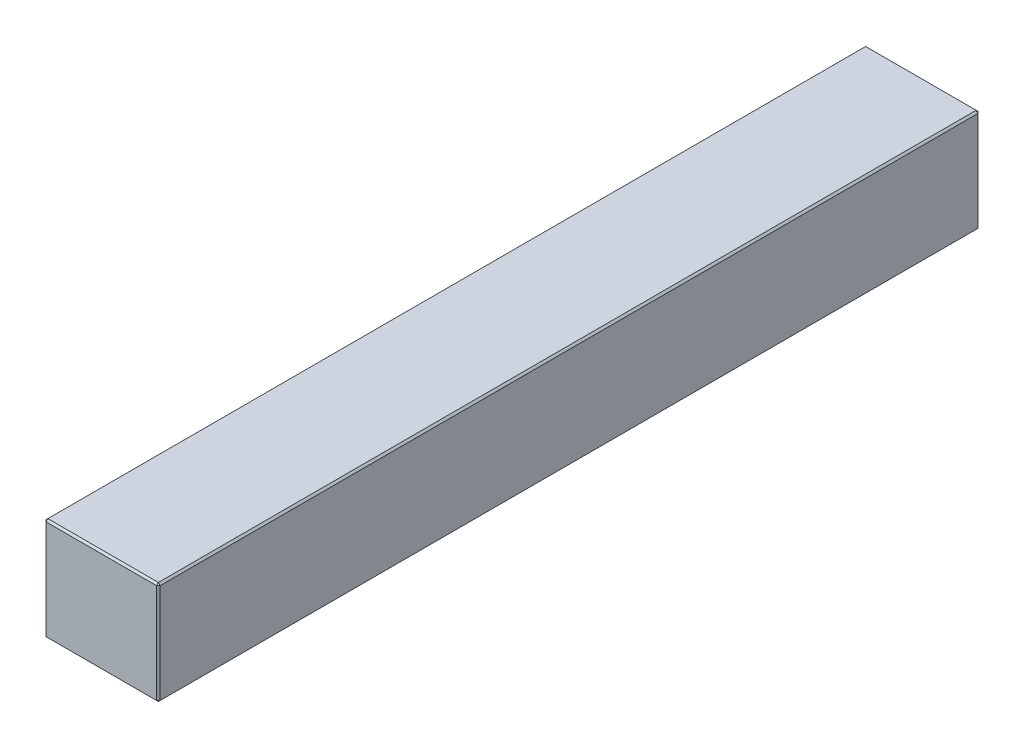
ISO-10303-21;
HEADER;
FILE_DESCRIPTION(('STEP AP214'),'2;1');
FILE_NAME('part.step','',(''),(''),'','','');
FILE_SCHEMA(('AUTOMOTIVE_DESIGN { 1 0 10303 214 1 1 1 1 }'));
ENDSEC;
DATA;
#1=APPLICATION_CONTEXT('core data for automotive mechanical design processes');
#2=APPLICATION_PROTOCOL_DEFINITION('international standard','automotive_design',2000,#1);
#3=PRODUCT_CONTEXT('',#1,'mechanical');
#4=PRODUCT('Part','Part','',(#3));
#5=PRODUCT_RELATED_PRODUCT_CATEGORY('part','',(#4));
#6=PRODUCT_DEFINITION_FORMATION('','',#4);
#7=PRODUCT_DEFINITION_CONTEXT('part definition',#1,'design');
#8=PRODUCT_DEFINITION('design','',#6,#7);
#9=PRODUCT_DEFINITION_SHAPE('','',#8);
#10=(LENGTH_UNIT() NAMED_UNIT(*) SI_UNIT(.MILLI.,.METRE.));
#11=(NAMED_UNIT(*) PLANE_ANGLE_UNIT() SI_UNIT($,.RADIAN.));
#12=(NAMED_UNIT(*) SI_UNIT($,.STERADIAN.) SOLID_ANGLE_UNIT());
#13=UNCERTAINTY_MEASURE_WITH_UNIT(LENGTH_MEASURE(1.E-05),#10,'distance_accuracy_value','');
#14=(GEOMETRIC_REPRESENTATION_CONTEXT(3) GLOBAL_UNCERTAINTY_ASSIGNED_CONTEXT((#13)) GLOBAL_UNIT_ASSIGNED_CONTEXT((#10,
#11,#12)) REPRESENTATION_CONTEXT('',''));
#15=CARTESIAN_POINT('',(0.,0.,0.));
#16=DIRECTION('',(0.,0.,1.));
#17=DIRECTION('',(1.,0.,0.));
#18=AXIS2_PLACEMENT_3D('',#15,#16,#17);
#19=CARTESIAN_POINT('',(-31.,56.,223.));
#20=DIRECTION('',(1.,0.,0.));
#21=DIRECTION('',(0.,0.,-1.));
#22=AXIS2_PLACEMENT_3D('',#19,#20,#21);
#23=PLANE('',#22);
#24=DIRECTION('',(0.,-1.,0.));
#25=VECTOR('',#24,1.);
#26=CARTESIAN_POINT('',(-31.,56.,-222.));
#27=LINE('',#26,#25);
#28=CARTESIAN_POINT('',(-31.,55.,-222.));
#29=VERTEX_POINT('',#28);
#30=CARTESIAN_POINT('',(-31.,1.,-222.));
#31=VERTEX_POINT('',#30);
#32=EDGE_CURVE('E114',#29,#31,#27,.T.);
#33=ORIENTED_EDGE('',*,*,#32,.T.);
#34=DIRECTION('',(0.,0.,1.));
#35=VECTOR('',#34,1.);
#36=CARTESIAN_POINT('',(-31.,1.,223.));
#37=LINE('',#36,#35);
#38=CARTESIAN_POINT('',(-31.,1.,222.));
#39=VERTEX_POINT('',#38);
#40=EDGE_CURVE('E110',#31,#39,#37,.T.);
#41=ORIENTED_EDGE('',*,*,#40,.T.);
#42=DIRECTION('',(0.,1.,0.));
#43=VECTOR('',#42,1.);
#44=CARTESIAN_POINT('',(-31.,56.,222.));
#45=LINE('',#44,#43);
#46=CARTESIAN_POINT('',(-31.,55.,222.));
#47=VERTEX_POINT('',#46);
#48=EDGE_CURVE('E103',#39,#47,#45,.T.);
#49=ORIENTED_EDGE('',*,*,#48,.T.);
#50=DIRECTION('',(0.,0.,-1.));
#51=VECTOR('',#50,1.);
#52=CARTESIAN_POINT('',(-31.,55.,-223.));
#53=LINE('',#52,#51);
#54=EDGE_CURVE('E107',#47,#29,#53,.T.);
#55=ORIENTED_EDGE('',*,*,#54,.T.);
#56=EDGE_LOOP('',(#33,#41,#49,#55));
#57=FACE_BOUND('',#56,.T.);
#58=ADVANCED_FACE('F15',(#57),#23,.F.);
#59=CARTESIAN_POINT('',(31.,56.,223.));
#60=DIRECTION('',(0.,0.,-1.));
#61=DIRECTION('',(-1.,0.,0.));
#62=AXIS2_PLACEMENT_3D('',#59,#60,#61);
#63=PLANE('',#62);
#64=DIRECTION('',(-1.,0.,0.));
#65=VECTOR('',#64,1.);
#66=CARTESIAN_POINT('',(-31.,55.,223.));
#67=LINE('',#66,#65);
#68=CARTESIAN_POINT('',(30.,55.,223.));
#69=VERTEX_POINT('',#68);
#70=CARTESIAN_POINT('',(-30.,55.,223.));
#71=VERTEX_POINT('',#70);
#72=EDGE_CURVE('E164',#69,#71,#67,.T.);
#73=ORIENTED_EDGE('',*,*,#72,.T.);
#74=DIRECTION('',(0.,-1.,0.));
#75=VECTOR('',#74,1.);
#76=CARTESIAN_POINT('',(-30.,56.,223.));
#77=LINE('',#76,#75);
#78=CARTESIAN_POINT('',(-30.,1.,223.));
#79=VERTEX_POINT('',#78);
#80=EDGE_CURVE('E122',#71,#79,#77,.T.);
#81=ORIENTED_EDGE('',*,*,#80,.T.);
#82=DIRECTION('',(1.,0.,0.));
#83=VECTOR('',#82,1.);
#84=CARTESIAN_POINT('',(31.,1.,223.));
#85=LINE('',#84,#83);
#86=CARTESIAN_POINT('',(30.,1.,223.));
#87=VERTEX_POINT('',#86);
#88=EDGE_CURVE('E168',#79,#87,#85,.T.);
#89=ORIENTED_EDGE('',*,*,#88,.T.);
#90=DIRECTION('',(0.,1.,0.));
#91=VECTOR('',#90,1.);
#92=CARTESIAN_POINT('',(30.,56.,223.));
#93=LINE('',#92,#91);
#94=EDGE_CURVE('E166',#87,#69,#93,.T.);
#95=ORIENTED_EDGE('',*,*,#94,.T.);
#96=EDGE_LOOP('',(#73,#81,#89,#95));
#97=FACE_BOUND('',#96,.T.);
#98=ADVANCED_FACE('F275',(#97),#63,.F.);
#99=CARTESIAN_POINT('',(31.,56.,223.));
#100=DIRECTION('',(-1.,0.,0.));
#101=DIRECTION('',(0.,0.,1.));
#102=AXIS2_PLACEMENT_3D('',#99,#100,#101);
#103=PLANE('',#102);
#104=DIRECTION('',(0.,0.,-1.));
#105=VECTOR('',#104,1.);
#106=CARTESIAN_POINT('',(31.,1.,223.));
#107=LINE('',#106,#105);
#108=CARTESIAN_POINT('',(31.,1.,222.));
#109=VERTEX_POINT('',#108);
#110=CARTESIAN_POINT('',(31.,1.,-222.));
#111=VERTEX_POINT('',#110);
#112=EDGE_CURVE('E159',#109,#111,#107,.T.);
#113=ORIENTED_EDGE('',*,*,#112,.T.);
#114=DIRECTION('',(0.,1.,0.));
#115=VECTOR('',#114,1.);
#116=CARTESIAN_POINT('',(31.,56.,-222.));
#117=LINE('',#116,#115);
#118=CARTESIAN_POINT('',(31.,55.,-222.));
#119=VERTEX_POINT('',#118);
#120=EDGE_CURVE('E161',#111,#119,#117,.T.);
#121=ORIENTED_EDGE('',*,*,#120,.T.);
#122=DIRECTION('',(0.,0.,1.));
#123=VECTOR('',#122,1.);
#124=CARTESIAN_POINT('',(31.,55.,223.));
#125=LINE('',#124,#123);
#126=CARTESIAN_POINT('',(31.,55.,222.));
#127=VERTEX_POINT('',#126);
#128=EDGE_CURVE('E155',#119,#127,#125,.T.);
#129=ORIENTED_EDGE('',*,*,#128,.T.);
#130=DIRECTION('',(0.,-1.,0.));
#131=VECTOR('',#130,1.);
#132=CARTESIAN_POINT('',(31.,56.,222.));
#133=LINE('',#132,#131);
#134=EDGE_CURVE('E157',#127,#109,#133,.T.);
#135=ORIENTED_EDGE('',*,*,#134,.T.);
#136=EDGE_LOOP('',(#113,#121,#129,#135));
#137=FACE_BOUND('',#136,.T.);
#138=ADVANCED_FACE('F254',(#137),#103,.F.);
#139=CARTESIAN_POINT('',(31.,56.,-223.));
#140=DIRECTION('',(0.,0.,1.));
#141=DIRECTION('',(1.,0.,0.));
#142=AXIS2_PLACEMENT_3D('',#139,#140,#141);
#143=PLANE('',#142);
#144=DIRECTION('',(0.,-1.,0.));
#145=VECTOR('',#144,1.);
#146=CARTESIAN_POINT('',(30.,56.,-223.));
#147=LINE('',#146,#145);
#148=CARTESIAN_POINT('',(30.,55.,-223.));
#149=VERTEX_POINT('',#148);
#150=CARTESIAN_POINT('',(30.,1.,-223.));
#151=VERTEX_POINT('',#150);
#152=EDGE_CURVE('E148',#149,#151,#147,.T.);
#153=ORIENTED_EDGE('',*,*,#152,.T.);
#154=DIRECTION('',(-1.,0.,0.));
#155=VECTOR('',#154,1.);
#156=CARTESIAN_POINT('',(31.,1.,-223.));
#157=LINE('',#156,#155);
#158=CARTESIAN_POINT('',(-30.,1.,-223.));
#159=VERTEX_POINT('',#158);
#160=EDGE_CURVE('E153',#151,#159,#157,.T.);
#161=ORIENTED_EDGE('',*,*,#160,.T.);
#162=DIRECTION('',(0.,1.,0.));
#163=VECTOR('',#162,1.);
#164=CARTESIAN_POINT('',(-30.,56.,-223.));
#165=LINE('',#164,#163);
#166=CARTESIAN_POINT('',(-30.,55.,-223.));
#167=VERTEX_POINT('',#166);
#168=EDGE_CURVE('E150',#159,#167,#165,.T.);
#169=ORIENTED_EDGE('',*,*,#168,.T.);
#170=DIRECTION('',(1.,0.,0.));
#171=VECTOR('',#170,1.);
#172=CARTESIAN_POINT('',(31.,55.,-223.));
#173=LINE('',#172,#171);
#174=EDGE_CURVE('E146',#167,#149,#173,.T.);
#175=ORIENTED_EDGE('',*,*,#174,.T.);
#176=EDGE_LOOP('',(#153,#161,#169,#175));
#177=FACE_BOUND('',#176,.T.);
#178=ADVANCED_FACE('F284',(#177),#143,.F.);
#179=CARTESIAN_POINT('',(0.,56.,0.));
#180=DIRECTION('',(0.,1.,0.));
#181=DIRECTION('',(0.,0.,1.));
#182=AXIS2_PLACEMENT_3D('',#179,#180,#181);
#183=PLANE('',#182);
#184=DIRECTION('',(0.,0.,-1.));
#185=VECTOR('',#184,1.);
#186=CARTESIAN_POINT('',(30.,56.,-223.));
#187=LINE('',#186,#185);
#188=CARTESIAN_POINT('',(30.,56.,222.));
#189=VERTEX_POINT('',#188);
#190=CARTESIAN_POINT('',(30.,56.,-222.));
#191=VERTEX_POINT('',#190);
#192=EDGE_CURVE('E24',#189,#191,#187,.T.);
#193=ORIENTED_EDGE('',*,*,#192,.T.);
#194=DIRECTION('',(-1.,0.,0.));
#195=VECTOR('',#194,1.);
#196=CARTESIAN_POINT('',(-31.,56.,-222.));
#197=LINE('',#196,#195);
#198=CARTESIAN_POINT('',(-30.,56.,-222.));
#199=VERTEX_POINT('',#198);
#200=EDGE_CURVE('E9',#191,#199,#197,.T.);
#201=ORIENTED_EDGE('',*,*,#200,.T.);
#202=DIRECTION('',(0.,0.,1.));
#203=VECTOR('',#202,1.);
#204=CARTESIAN_POINT('',(-30.,56.,223.));
#205=LINE('',#204,#203);
#206=CARTESIAN_POINT('',(-30.,56.,222.));
#207=VERTEX_POINT('',#206);
#208=EDGE_CURVE('E180',#199,#207,#205,.T.);
#209=ORIENTED_EDGE('',*,*,#208,.T.);
#210=DIRECTION('',(1.,0.,0.));
#211=VECTOR('',#210,1.);
#212=CARTESIAN_POINT('',(31.,56.,222.));
#213=LINE('',#212,#211);
#214=EDGE_CURVE('E35',#207,#189,#213,.T.);
#215=ORIENTED_EDGE('',*,*,#214,.T.);
#216=EDGE_LOOP('',(#193,#201,#209,#215));
#217=FACE_BOUND('',#216,.T.);
#218=ADVANCED_FACE('F350',(#217),#183,.T.);
#219=CARTESIAN_POINT('',(0.,0.,0.));
#220=DIRECTION('',(0.,1.,0.));
#221=DIRECTION('',(0.,0.,1.));
#222=AXIS2_PLACEMENT_3D('',#219,#220,#221);
#223=PLANE('',#222);
#224=DIRECTION('',(0.,0.,1.));
#225=VECTOR('',#224,1.);
#226=CARTESIAN_POINT('',(30.,0.,0.));
#227=LINE('',#226,#225);
#228=CARTESIAN_POINT('',(30.,0.,-222.));
#229=VERTEX_POINT('',#228);
#230=CARTESIAN_POINT('',(30.,0.,222.));
#231=VERTEX_POINT('',#230);
#232=EDGE_CURVE('E171',#229,#231,#227,.T.);
#233=ORIENTED_EDGE('',*,*,#232,.T.);
#234=DIRECTION('',(-1.,0.,0.));
#235=VECTOR('',#234,1.);
#236=CARTESIAN_POINT('',(0.,0.,222.));
#237=LINE('',#236,#235);
#238=CARTESIAN_POINT('',(-30.,0.,222.));
#239=VERTEX_POINT('',#238);
#240=EDGE_CURVE('E177',#231,#239,#237,.T.);
#241=ORIENTED_EDGE('',*,*,#240,.T.);
#242=DIRECTION('',(0.,0.,-1.));
#243=VECTOR('',#242,1.);
#244=CARTESIAN_POINT('',(-30.,0.,0.));
#245=LINE('',#244,#243);
#246=CARTESIAN_POINT('',(-30.,0.,-222.));
#247=VERTEX_POINT('',#246);
#248=EDGE_CURVE('E175',#239,#247,#245,.T.);
#249=ORIENTED_EDGE('',*,*,#248,.T.);
#250=DIRECTION('',(1.,0.,0.));
#251=VECTOR('',#250,1.);
#252=CARTESIAN_POINT('',(0.,0.,-222.));
#253=LINE('',#252,#251);
#254=EDGE_CURVE('E173',#247,#229,#253,.T.);
#255=ORIENTED_EDGE('',*,*,#254,.T.);
#256=EDGE_LOOP('',(#233,#241,#249,#255));
#257=FACE_BOUND('',#256,.T.);
#258=ADVANCED_FACE('F246',(#257),#223,.F.);
#259=CARTESIAN_POINT('',(31.,56.,222.));
#260=DIRECTION('',(-0.707106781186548,0.,-0.707106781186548));
#261=DIRECTION('',(0.,-1.,0.));
#262=AXIS2_PLACEMENT_3D('',#259,#260,#261);
#263=PLANE('',#262);
#264=DIRECTION('',(-0.707106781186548,0.,0.707106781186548));
#265=VECTOR('',#264,1.);
#266=CARTESIAN_POINT('',(30.,55.,223.));
#267=LINE('',#266,#265);
#268=EDGE_CURVE('E19',#69,#127,#267,.F.);
#269=ORIENTED_EDGE('',*,*,#268,.F.);
#270=ORIENTED_EDGE('',*,*,#94,.F.);
#271=DIRECTION('',(0.707106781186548,0.,-0.707106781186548));
#272=VECTOR('',#271,1.);
#273=CARTESIAN_POINT('',(30.,1.,223.));
#274=LINE('',#273,#272);
#275=EDGE_CURVE('E142',#109,#87,#274,.F.);
#276=ORIENTED_EDGE('',*,*,#275,.F.);
#277=ORIENTED_EDGE('',*,*,#134,.F.);
#278=EDGE_LOOP('',(#269,#270,#276,#277));
#279=FACE_BOUND('',#278,.T.);
#280=ADVANCED_FACE('F17',(#279),#263,.F.);
#281=CARTESIAN_POINT('',(30.,55.,223.));
#282=DIRECTION('',(0.577350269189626,0.577350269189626,0.577350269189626));
#283=DIRECTION('',(0.707106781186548,0.,-0.707106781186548));
#284=AXIS2_PLACEMENT_3D('',#281,#282,#283);
#285=PLANE('',#284);
#286=DIRECTION('',(0.,-0.707106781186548,0.707106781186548));
#287=VECTOR('',#286,1.);
#288=CARTESIAN_POINT('',(30.,55.,223.));
#289=LINE('',#288,#287);
#290=EDGE_CURVE('E226',#69,#189,#289,.F.);
#291=ORIENTED_EDGE('',*,*,#290,.F.);
#292=ORIENTED_EDGE('',*,*,#268,.T.);
#293=DIRECTION('',(-0.707106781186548,0.707106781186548,0.));
#294=VECTOR('',#293,1.);
#295=CARTESIAN_POINT('',(30.5,55.5,222.));
#296=LINE('',#295,#294);
#297=EDGE_CURVE('E228',#189,#127,#296,.F.);
#298=ORIENTED_EDGE('',*,*,#297,.F.);
#299=EDGE_LOOP('',(#291,#292,#298));
#300=FACE_BOUND('',#299,.T.);
#301=ADVANCED_FACE('F270',(#300),#285,.T.);
#302=CARTESIAN_POINT('',(30.,1.,223.));
#303=DIRECTION('',(0.577350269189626,-0.577350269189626,0.577350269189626));
#304=DIRECTION('',(0.707106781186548,0.,-0.707106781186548));
#305=AXIS2_PLACEMENT_3D('',#302,#303,#304);
#306=PLANE('',#305);
#307=DIRECTION('',(-0.707106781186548,-0.707106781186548,0.));
#308=VECTOR('',#307,1.);
#309=CARTESIAN_POINT('',(30.5,0.5,222.));
#310=LINE('',#309,#308);
#311=EDGE_CURVE('E220',#109,#231,#310,.T.);
#312=ORIENTED_EDGE('',*,*,#311,.F.);
#313=ORIENTED_EDGE('',*,*,#275,.T.);
#314=DIRECTION('',(0.,0.707106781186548,0.707106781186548));
#315=VECTOR('',#314,1.);
#316=CARTESIAN_POINT('',(30.,1.,223.));
#317=LINE('',#316,#315);
#318=EDGE_CURVE('E223',#231,#87,#317,.T.);
#319=ORIENTED_EDGE('',*,*,#318,.F.);
#320=EDGE_LOOP('',(#312,#313,#319));
#321=FACE_BOUND('',#320,.T.);
#322=ADVANCED_FACE('F235',(#321),#306,.T.);
#323=CARTESIAN_POINT('',(30.,56.,0.));
#324=DIRECTION('',(0.707106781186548,0.707106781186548,0.));
#325=DIRECTION('',(0.,0.,1.));
#326=AXIS2_PLACEMENT_3D('',#323,#324,#325);
#327=PLANE('',#326);
#328=ORIENTED_EDGE('',*,*,#297,.T.);
#329=ORIENTED_EDGE('',*,*,#128,.F.);
#330=DIRECTION('',(0.707106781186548,-0.707106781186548,0.));
#331=VECTOR('',#330,1.);
#332=CARTESIAN_POINT('',(31.,55.,-222.));
#333=LINE('',#332,#331);
#334=EDGE_CURVE('E215',#191,#119,#333,.T.);
#335=ORIENTED_EDGE('',*,*,#334,.F.);
#336=ORIENTED_EDGE('',*,*,#192,.F.);
#337=EDGE_LOOP('',(#328,#329,#335,#336));
#338=FACE_BOUND('',#337,.T.);
#339=ADVANCED_FACE('F265',(#338),#327,.T.);
#340=CARTESIAN_POINT('',(0.,56.,222.));
#341=DIRECTION('',(0.,0.707106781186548,0.707106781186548));
#342=DIRECTION('',(-1.,0.,0.));
#343=AXIS2_PLACEMENT_3D('',#340,#341,#342);
#344=PLANE('',#343);
#345=ORIENTED_EDGE('',*,*,#290,.T.);
#346=ORIENTED_EDGE('',*,*,#214,.F.);
#347=DIRECTION('',(0.,0.707106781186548,-0.707106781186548));
#348=VECTOR('',#347,1.);
#349=CARTESIAN_POINT('',(-30.,55.5,222.5));
#350=LINE('',#349,#348);
#351=EDGE_CURVE('E126',#71,#207,#350,.T.);
#352=ORIENTED_EDGE('',*,*,#351,.F.);
#353=ORIENTED_EDGE('',*,*,#72,.F.);
#354=EDGE_LOOP('',(#345,#346,#352,#353));
#355=FACE_BOUND('',#354,.T.);
#356=ADVANCED_FACE('F273',(#355),#344,.T.);
#357=CARTESIAN_POINT('',(-30.,56.,223.));
#358=DIRECTION('',(0.707106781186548,0.,-0.707106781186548));
#359=DIRECTION('',(0.,-1.,0.));
#360=AXIS2_PLACEMENT_3D('',#357,#358,#359);
#361=PLANE('',#360);
#362=DIRECTION('',(0.707106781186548,0.,0.707106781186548));
#363=VECTOR('',#362,1.);
#364=CARTESIAN_POINT('',(-30.,1.,223.));
#365=LINE('',#364,#363);
#366=EDGE_CURVE('E127',#79,#39,#365,.F.);
#367=ORIENTED_EDGE('',*,*,#366,.F.);
#368=ORIENTED_EDGE('',*,*,#80,.F.);
#369=DIRECTION('',(-0.707106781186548,0.,-0.707106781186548));
#370=VECTOR('',#369,1.);
#371=CARTESIAN_POINT('',(-31.,55.,222.));
#372=LINE('',#371,#370);
#373=EDGE_CURVE('E118',#47,#71,#372,.F.);
#374=ORIENTED_EDGE('',*,*,#373,.F.);
#375=ORIENTED_EDGE('',*,*,#48,.F.);
#376=EDGE_LOOP('',(#367,#368,#374,#375));
#377=FACE_BOUND('',#376,.T.);
#378=ADVANCED_FACE('F120',(#377),#361,.F.);
#379=CARTESIAN_POINT('',(31.,1.,223.));
#380=DIRECTION('',(0.,0.707106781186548,-0.707106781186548));
#381=DIRECTION('',(1.,0.,0.));
#382=AXIS2_PLACEMENT_3D('',#379,#380,#381);
#383=PLANE('',#382);
#384=ORIENTED_EDGE('',*,*,#318,.T.);
#385=ORIENTED_EDGE('',*,*,#88,.F.);
#386=DIRECTION('',(0.,-0.707106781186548,-0.707106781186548));
#387=VECTOR('',#386,1.);
#388=CARTESIAN_POINT('',(-30.,1.,223.));
#389=LINE('',#388,#387);
#390=EDGE_CURVE('E211',#239,#79,#389,.F.);
#391=ORIENTED_EDGE('',*,*,#390,.F.);
#392=ORIENTED_EDGE('',*,*,#240,.F.);
#393=EDGE_LOOP('',(#384,#385,#391,#392));
#394=FACE_BOUND('',#393,.T.);
#395=ADVANCED_FACE('F243',(#394),#383,.F.);
#396=CARTESIAN_POINT('',(31.,1.,223.));
#397=DIRECTION('',(-0.707106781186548,0.707106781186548,0.));
#398=DIRECTION('',(0.,0.,-1.));
#399=AXIS2_PLACEMENT_3D('',#396,#397,#398);
#400=PLANE('',#399);
#401=ORIENTED_EDGE('',*,*,#311,.T.);
#402=ORIENTED_EDGE('',*,*,#232,.F.);
#403=DIRECTION('',(0.707106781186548,0.707106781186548,0.));
#404=VECTOR('',#403,1.);
#405=CARTESIAN_POINT('',(30.5,0.5,-222.));
#406=LINE('',#405,#404);
#407=EDGE_CURVE('E208',#111,#229,#406,.F.);
#408=ORIENTED_EDGE('',*,*,#407,.F.);
#409=ORIENTED_EDGE('',*,*,#112,.F.);
#410=EDGE_LOOP('',(#401,#402,#408,#409));
#411=FACE_BOUND('',#410,.T.);
#412=ADVANCED_FACE('F251',(#411),#400,.F.);
#413=CARTESIAN_POINT('',(30.,56.,-223.));
#414=DIRECTION('',(-0.707106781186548,0.,0.707106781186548));
#415=DIRECTION('',(0.,-1.,0.));
#416=AXIS2_PLACEMENT_3D('',#413,#414,#415);
#417=PLANE('',#416);
#418=DIRECTION('',(0.707106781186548,0.,0.707106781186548));
#419=VECTOR('',#418,1.);
#420=CARTESIAN_POINT('',(31.,55.,-222.));
#421=LINE('',#420,#419);
#422=EDGE_CURVE('E217',#119,#149,#421,.F.);
#423=ORIENTED_EDGE('',*,*,#422,.F.);
#424=ORIENTED_EDGE('',*,*,#120,.F.);
#425=DIRECTION('',(-0.707106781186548,0.,-0.707106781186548));
#426=VECTOR('',#425,1.);
#427=CARTESIAN_POINT('',(30.,1.,-223.));
#428=LINE('',#427,#426);
#429=EDGE_CURVE('E205',#151,#111,#428,.F.);
#430=ORIENTED_EDGE('',*,*,#429,.F.);
#431=ORIENTED_EDGE('',*,*,#152,.F.);
#432=EDGE_LOOP('',(#423,#424,#430,#431));
#433=FACE_BOUND('',#432,.T.);
#434=ADVANCED_FACE('F258',(#433),#417,.F.);
#435=CARTESIAN_POINT('',(31.,55.,-222.));
#436=DIRECTION('',(0.577350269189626,0.577350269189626,-0.577350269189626));
#437=DIRECTION('',(-0.707106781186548,0.,-0.707106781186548));
#438=AXIS2_PLACEMENT_3D('',#435,#436,#437);
#439=PLANE('',#438);
#440=ORIENTED_EDGE('',*,*,#334,.T.);
#441=ORIENTED_EDGE('',*,*,#422,.T.);
#442=DIRECTION('',(0.,0.707106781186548,0.707106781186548));
#443=VECTOR('',#442,1.);
#444=CARTESIAN_POINT('',(30.,55.5,-222.5));
#445=LINE('',#444,#443);
#446=EDGE_CURVE('E134',#191,#149,#445,.F.);
#447=ORIENTED_EDGE('',*,*,#446,.F.);
#448=EDGE_LOOP('',(#440,#441,#447));
#449=FACE_BOUND('',#448,.T.);
#450=ADVANCED_FACE('F325',(#449),#439,.T.);
#451=CARTESIAN_POINT('',(-31.,55.,222.));
#452=DIRECTION('',(-0.577350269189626,0.577350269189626,0.577350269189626));
#453=DIRECTION('',(0.707106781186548,0.,0.707106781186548));
#454=AXIS2_PLACEMENT_3D('',#451,#452,#453);
#455=PLANE('',#454);
#456=ORIENTED_EDGE('',*,*,#373,.T.);
#457=ORIENTED_EDGE('',*,*,#351,.T.);
#458=DIRECTION('',(-0.707106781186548,-0.707106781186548,0.));
#459=VECTOR('',#458,1.);
#460=CARTESIAN_POINT('',(-31.,55.,222.));
#461=LINE('',#460,#459);
#462=EDGE_CURVE('E130',#47,#207,#461,.F.);
#463=ORIENTED_EDGE('',*,*,#462,.F.);
#464=EDGE_LOOP('',(#456,#457,#463));
#465=FACE_BOUND('',#464,.T.);
#466=ADVANCED_FACE('F131',(#465),#455,.T.);
#467=CARTESIAN_POINT('',(-30.,1.,223.));
#468=DIRECTION('',(-0.577350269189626,-0.577350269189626,0.577350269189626));
#469=DIRECTION('',(0.707106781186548,0.,0.707106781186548));
#470=AXIS2_PLACEMENT_3D('',#467,#468,#469);
#471=PLANE('',#470);
#472=ORIENTED_EDGE('',*,*,#390,.T.);
#473=ORIENTED_EDGE('',*,*,#366,.T.);
#474=DIRECTION('',(-0.707106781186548,0.707106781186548,0.));
#475=VECTOR('',#474,1.);
#476=CARTESIAN_POINT('',(-30.5,0.5,222.));
#477=LINE('',#476,#475);
#478=EDGE_CURVE('E135',#239,#39,#477,.T.);
#479=ORIENTED_EDGE('',*,*,#478,.F.);
#480=EDGE_LOOP('',(#472,#473,#479));
#481=FACE_BOUND('',#480,.T.);
#482=ADVANCED_FACE('F318',(#481),#471,.T.);
#483=CARTESIAN_POINT('',(30.,1.,-223.));
#484=DIRECTION('',(0.577350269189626,-0.577350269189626,-0.577350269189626));
#485=DIRECTION('',(-0.707106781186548,0.,-0.707106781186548));
#486=AXIS2_PLACEMENT_3D('',#483,#484,#485);
#487=PLANE('',#486);
#488=ORIENTED_EDGE('',*,*,#429,.T.);
#489=ORIENTED_EDGE('',*,*,#407,.T.);
#490=DIRECTION('',(0.,-0.707106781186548,0.707106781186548));
#491=VECTOR('',#490,1.);
#492=CARTESIAN_POINT('',(30.,1.,-223.));
#493=LINE('',#492,#491);
#494=EDGE_CURVE('E198',#151,#229,#493,.T.);
#495=ORIENTED_EDGE('',*,*,#494,.F.);
#496=EDGE_LOOP('',(#488,#489,#495));
#497=FACE_BOUND('',#496,.T.);
#498=ADVANCED_FACE('F314',(#497),#487,.T.);
#499=CARTESIAN_POINT('',(0.,56.,-222.));
#500=DIRECTION('',(0.,0.707106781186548,-0.707106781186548));
#501=DIRECTION('',(1.,0.,0.));
#502=AXIS2_PLACEMENT_3D('',#499,#500,#501);
#503=PLANE('',#502);
#504=ORIENTED_EDGE('',*,*,#446,.T.);
#505=ORIENTED_EDGE('',*,*,#174,.F.);
#506=DIRECTION('',(0.,-0.707106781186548,-0.707106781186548));
#507=VECTOR('',#506,1.);
#508=CARTESIAN_POINT('',(-30.,55.,-223.));
#509=LINE('',#508,#507);
#510=EDGE_CURVE('E195',#199,#167,#509,.T.);
#511=ORIENTED_EDGE('',*,*,#510,.F.);
#512=ORIENTED_EDGE('',*,*,#200,.F.);
#513=EDGE_LOOP('',(#504,#505,#511,#512));
#514=FACE_BOUND('',#513,.T.);
#515=ADVANCED_FACE('F311',(#514),#503,.T.);
#516=CARTESIAN_POINT('',(-30.,56.,0.));
#517=DIRECTION('',(-0.707106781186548,0.707106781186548,0.));
#518=DIRECTION('',(0.,0.,-1.));
#519=AXIS2_PLACEMENT_3D('',#516,#517,#518);
#520=PLANE('',#519);
#521=ORIENTED_EDGE('',*,*,#462,.T.);
#522=ORIENTED_EDGE('',*,*,#208,.F.);
#523=DIRECTION('',(0.707106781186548,0.707106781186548,0.));
#524=VECTOR('',#523,1.);
#525=CARTESIAN_POINT('',(-30.5,55.5,-222.));
#526=LINE('',#525,#524);
#527=EDGE_CURVE('E138',#29,#199,#526,.T.);
#528=ORIENTED_EDGE('',*,*,#527,.F.);
#529=ORIENTED_EDGE('',*,*,#54,.F.);
#530=EDGE_LOOP('',(#521,#522,#528,#529));
#531=FACE_BOUND('',#530,.T.);
#532=ADVANCED_FACE('F137',(#531),#520,.T.);
#533=CARTESIAN_POINT('',(-31.,1.,223.));
#534=DIRECTION('',(0.707106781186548,0.707106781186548,0.));
#535=DIRECTION('',(0.,0.,1.));
#536=AXIS2_PLACEMENT_3D('',#533,#534,#535);
#537=PLANE('',#536);
#538=ORIENTED_EDGE('',*,*,#478,.T.);
#539=ORIENTED_EDGE('',*,*,#40,.F.);
#540=DIRECTION('',(0.707106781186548,-0.707106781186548,0.));
#541=VECTOR('',#540,1.);
#542=CARTESIAN_POINT('',(-31.,1.,-222.));
#543=LINE('',#542,#541);
#544=EDGE_CURVE('E191',#247,#31,#543,.F.);
#545=ORIENTED_EDGE('',*,*,#544,.F.);
#546=ORIENTED_EDGE('',*,*,#248,.F.);
#547=EDGE_LOOP('',(#538,#539,#545,#546));
#548=FACE_BOUND('',#547,.T.);
#549=ADVANCED_FACE('F304',(#548),#537,.F.);
#550=CARTESIAN_POINT('',(31.,1.,-223.));
#551=DIRECTION('',(0.,0.707106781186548,0.707106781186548));
#552=DIRECTION('',(-1.,0.,0.));
#553=AXIS2_PLACEMENT_3D('',#550,#551,#552);
#554=PLANE('',#553);
#555=ORIENTED_EDGE('',*,*,#494,.T.);
#556=ORIENTED_EDGE('',*,*,#254,.F.);
#557=DIRECTION('',(0.,0.707106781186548,-0.707106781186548));
#558=VECTOR('',#557,1.);
#559=CARTESIAN_POINT('',(-30.,0.5,-222.5));
#560=LINE('',#559,#558);
#561=EDGE_CURVE('E188',#159,#247,#560,.F.);
#562=ORIENTED_EDGE('',*,*,#561,.F.);
#563=ORIENTED_EDGE('',*,*,#160,.F.);
#564=EDGE_LOOP('',(#555,#556,#562,#563));
#565=FACE_BOUND('',#564,.T.);
#566=ADVANCED_FACE('F300',(#565),#554,.F.);
#567=CARTESIAN_POINT('',(-30.,55.,-223.));
#568=DIRECTION('',(-0.577350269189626,0.577350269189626,-0.577350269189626));
#569=DIRECTION('',(-0.707106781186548,0.,0.707106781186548));
#570=AXIS2_PLACEMENT_3D('',#567,#568,#569);
#571=PLANE('',#570);
#572=ORIENTED_EDGE('',*,*,#527,.T.);
#573=ORIENTED_EDGE('',*,*,#510,.T.);
#574=DIRECTION('',(0.707106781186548,0.,-0.707106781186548));
#575=VECTOR('',#574,1.);
#576=CARTESIAN_POINT('',(-30.,55.,-223.));
#577=LINE('',#576,#575);
#578=EDGE_CURVE('E186',#29,#167,#577,.T.);
#579=ORIENTED_EDGE('',*,*,#578,.F.);
#580=EDGE_LOOP('',(#572,#573,#579));
#581=FACE_BOUND('',#580,.T.);
#582=ADVANCED_FACE('F296',(#581),#571,.T.);
#583=CARTESIAN_POINT('',(-31.,1.,-222.));
#584=DIRECTION('',(-0.577350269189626,-0.577350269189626,-0.577350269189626));
#585=DIRECTION('',(-0.707106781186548,0.,0.707106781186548));
#586=AXIS2_PLACEMENT_3D('',#583,#584,#585);
#587=PLANE('',#586);
#588=ORIENTED_EDGE('',*,*,#561,.T.);
#589=ORIENTED_EDGE('',*,*,#544,.T.);
#590=DIRECTION('',(-0.707106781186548,0.,0.707106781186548));
#591=VECTOR('',#590,1.);
#592=CARTESIAN_POINT('',(-31.,1.,-222.));
#593=LINE('',#592,#591);
#594=EDGE_CURVE('E184',#159,#31,#593,.T.);
#595=ORIENTED_EDGE('',*,*,#594,.F.);
#596=EDGE_LOOP('',(#588,#589,#595));
#597=FACE_BOUND('',#596,.T.);
#598=ADVANCED_FACE('F292',(#597),#587,.T.);
#599=CARTESIAN_POINT('',(-31.,56.,-222.));
#600=DIRECTION('',(0.707106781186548,0.,0.707106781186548));
#601=DIRECTION('',(0.,-1.,0.));
#602=AXIS2_PLACEMENT_3D('',#599,#600,#601);
#603=PLANE('',#602);
#604=ORIENTED_EDGE('',*,*,#578,.T.);
#605=ORIENTED_EDGE('',*,*,#168,.F.);
#606=ORIENTED_EDGE('',*,*,#594,.T.);
#607=ORIENTED_EDGE('',*,*,#32,.F.);
#608=EDGE_LOOP('',(#604,#605,#606,#607));
#609=FACE_BOUND('',#608,.T.);
#610=ADVANCED_FACE('F289',(#609),#603,.F.);
#611=CLOSED_SHELL('',(#58,#98,#138,#178,#218,#258,#280,#301,#322,#339,#356,#378,#395,#412,#434,
#450,#466,#482,#498,#515,#532,#549,#566,#582,#598,#610));
#612=MANIFOLD_SOLID_BREP('B1',#611);
#613=ADVANCED_BREP_SHAPE_REPRESENTATION('',(#18,#612),#14);
#614=SHAPE_DEFINITION_REPRESENTATION(#9,#613);
ENDSEC;
END-ISO-10303-21;
